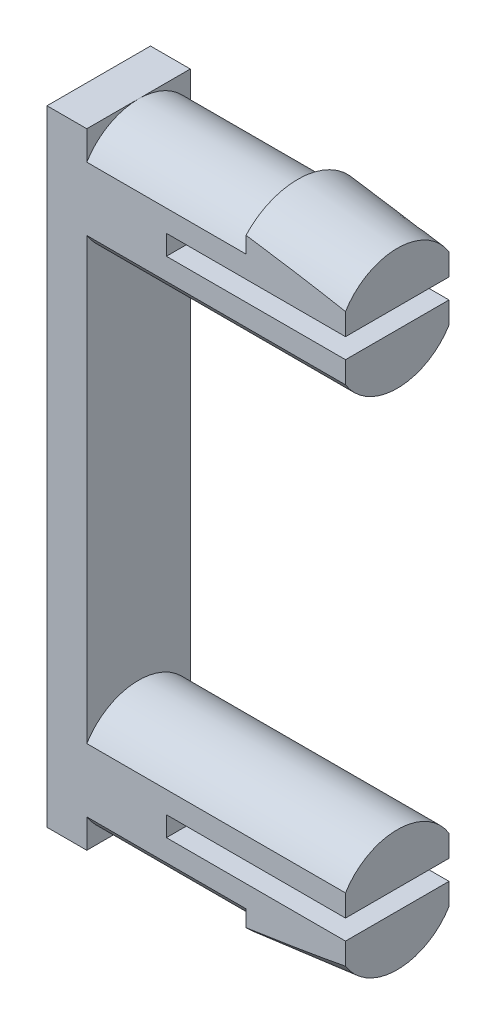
from build123d import *
from build123d.topology import SkipClean

# Parameters (mm, degrees)
BOSS_EXTRUDE2_DEPTH      = 3
REVOLVE4_ANGLE           = 90
REVOLVE4_OTHER_WAY_ANGLE = 90
SKETCH1_9_W              = 13
SKETCH1_9_H              = 3.05
REVOLVE6_ANGLE           = 90
REVOLVE6_OTHER_WAY_ANGLE = 90
SKETCH1_8_W              = 13
SKETCH1_8_H              = 3.05
REVOLVE5_ANGLE           = 90
REVOLVE5_OTHER_WAY_ANGLE = 90
REVOLVE7_ANGLE           = 90
REVOLVE7_OTHER_WAY_ANGLE = 90
SKETCH2_W                = 0.4
SKETCH2_H                = 31.4
SKETCH2_W_2              = 2
SKETCH2_W_3              = 1.6
CUT_EXTRUDE1_DEPTH       = 23.361630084
CUT_EXTRUDE2_REACH       = 24.034
SKETCH3_W                = 9
SKETCH3_H                = 1


with BuildPart() as part:
    # Sketch1 → Boss-Extrude2 (new, symmetric)
    with BuildSketch(Plane.XY):
        Polygon((1, 15.7), (-1, 15.7), (-1, -15.7), (1, -15.7), (1, -12.65), (1, -9.6), (1, 9.6), (1, 12.65), align=None)
    extrude(amount=BOSS_EXTRUDE2_DEPTH, both=True)

    # Sketch1_7 → Revolve4 (revolve)
    with BuildSketch(Plane.XY):
        Polygon((9, 15.7), (1, 15.7), (1, 12.65), (14, 12.65), (14, 15.7), (9, 16.2), align=None)
    revolve(axis=Axis((1, 12.65, 0), (1, 0, 0)), revolution_arc=REVOLVE4_ANGLE)

    # Sketch1_7 → Revolve4 other way (revolve)
    with BuildSketch(Plane.XY):
        Polygon((9, 15.7), (1, 15.7), (1, 12.65), (14, 12.65), (14, 15.7), (9, 16.2), align=None)
    revolve(axis=Axis((1, 12.65, 0), (-1, 0, 0)), revolution_arc=REVOLVE4_OTHER_WAY_ANGLE)

    # Sketch1_9 → Revolve6 (revolve)
    with BuildSketch(Plane.XY):
        with Locations((7.5, 11.125)):
            Rectangle(SKETCH1_9_W, SKETCH1_9_H)
    revolve(axis=Axis((1, 12.65, 0), (1, 0, 0)), revolution_arc=REVOLVE6_ANGLE)

    # Sketch1_9 → Revolve6 other way (revolve)
    with BuildSketch(Plane.XY):
        with Locations((7.5, 11.125)):
            Rectangle(SKETCH1_9_W, SKETCH1_9_H)
    revolve(axis=Axis((1, 12.65, 0), (-1, 0, 0)), revolution_arc=REVOLVE6_OTHER_WAY_ANGLE)

    # Sketch1_8 → Revolve5 (revolve)
    with BuildSketch(Plane.XY):
        with Locations((7.5, -11.125)):
            Rectangle(SKETCH1_8_W, SKETCH1_8_H)
    revolve(axis=Axis((1, -12.65, 0), (1, 0, 0)), revolution_arc=REVOLVE5_ANGLE)

    # Sketch1_8 → Revolve5 other way (revolve)
    with BuildSketch(Plane.XY):
        with Locations((7.5, -11.125)):
            Rectangle(SKETCH1_8_W, SKETCH1_8_H)
    revolve(axis=Axis((1, -12.65, 0), (-1, 0, 0)), revolution_arc=REVOLVE5_OTHER_WAY_ANGLE)

    # Sketch1_10 → Revolve7 (revolve)
    with BuildSketch(Plane.XY):
        Polygon((1, -12.65), (1, -15.7), (9, -15.7), (9, -16.2), (14, -15.7), (14, -12.65), align=None)
    revolve(axis=Axis((1, -12.65, 0), (1, 0, 0)), revolution_arc=REVOLVE7_ANGLE)

    # Sketch1_10 → Revolve7 other way (revolve)
    with SkipClean():  # the faces are left unmerged after this step: merging them gives an invalid solid
        with BuildSketch(Plane.XY):
            Polygon((1, -12.65), (1, -15.7), (9, -15.7), (9, -16.2), (14, -15.7), (14, -12.65), align=None)
        revolve(axis=Axis((1, -12.65, 0), (-1, 0, 0)), revolution_arc=REVOLVE7_OTHER_WAY_ANGLE)

    # Sketch2 → Cut-Extrude1 (cut, through all)
    with BuildSketch(Plane.ZY.offset(1)):
        with Locations((2.8, 0)):
            Rectangle(SKETCH2_W, SKETCH2_H)
        with Locations((-2.8, 0)):
            Rectangle(SKETCH2_W, SKETCH2_H)
        with Locations((-4, 0)):
            Rectangle(SKETCH2_W_2, SKETCH2_H)
        with Locations((3.8, 0)):
            Rectangle(SKETCH2_W_3, SKETCH2_H)
    extrude(amount=-CUT_EXTRUDE1_DEPTH, mode=Mode.SUBTRACT)

    # Sketch3 → Cut-Extrude2 (cut, up to next)
    with BuildSketch(Plane(origin=(0, 0, -2.6), x_dir=(-1, 0, 0), z_dir=(0, 0, -1)), mode=Mode.PRIVATE) as cut_extrude2_sk1:
        with Locations((-9.5, 12.65)):
            Rectangle(SKETCH3_W, SKETCH3_H)
    cut_extrude2_tool1 = extrude(cut_extrude2_sk1.sketch, amount=-CUT_EXTRUDE2_REACH, mode=Mode.PRIVATE) & part.part
    # Sketch3 → Cut-Extrude2 (cut, up to next)
    with BuildSketch(Plane(origin=(0, 0, -2.6), x_dir=(-1, 0, 0), z_dir=(0, 0, -1)), mode=Mode.PRIVATE) as cut_extrude2_sk2:
        with Locations((-9.5, -12.65)):
            Rectangle(SKETCH3_W, SKETCH3_H)
    cut_extrude2_tool2 = extrude(cut_extrude2_sk2.sketch, amount=-CUT_EXTRUDE2_REACH, mode=Mode.PRIVATE) & part.part
    add(cut_extrude2_tool1.solids().sort_by_distance((9.5, 12.65, -2.6))[0], mode=Mode.SUBTRACT)
    add(cut_extrude2_tool2.solids().sort_by_distance((9.5, -12.65, -2.6))[0], mode=Mode.SUBTRACT)


solid = part.part
